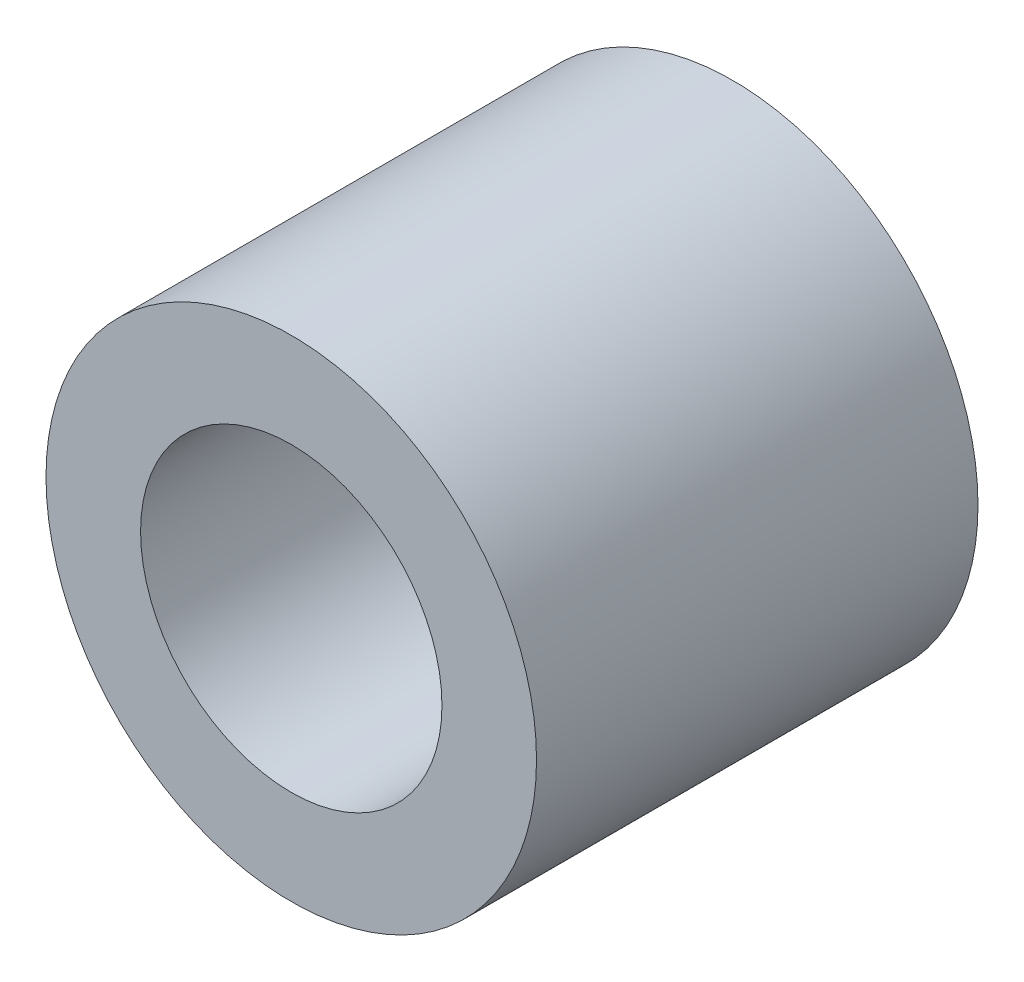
ISO-10303-21;
HEADER;
FILE_DESCRIPTION(('STEP AP214'),'2;1');
FILE_NAME('part.step','',(''),(''),'','','');
FILE_SCHEMA(('AUTOMOTIVE_DESIGN { 1 0 10303 214 1 1 1 1 }'));
ENDSEC;
DATA;
#1=APPLICATION_CONTEXT('core data for automotive mechanical design processes');
#2=APPLICATION_PROTOCOL_DEFINITION('international standard','automotive_design',2000,#1);
#3=PRODUCT_CONTEXT('',#1,'mechanical');
#4=PRODUCT('Part','Part','',(#3));
#5=PRODUCT_RELATED_PRODUCT_CATEGORY('part','',(#4));
#6=PRODUCT_DEFINITION_FORMATION('','',#4);
#7=PRODUCT_DEFINITION_CONTEXT('part definition',#1,'design');
#8=PRODUCT_DEFINITION('design','',#6,#7);
#9=PRODUCT_DEFINITION_SHAPE('','',#8);
#10=(LENGTH_UNIT() NAMED_UNIT(*) SI_UNIT(.MILLI.,.METRE.));
#11=(NAMED_UNIT(*) PLANE_ANGLE_UNIT() SI_UNIT($,.RADIAN.));
#12=(NAMED_UNIT(*) SI_UNIT($,.STERADIAN.) SOLID_ANGLE_UNIT());
#13=UNCERTAINTY_MEASURE_WITH_UNIT(LENGTH_MEASURE(1.E-05),#10,'distance_accuracy_value','');
#14=(GEOMETRIC_REPRESENTATION_CONTEXT(3) GLOBAL_UNCERTAINTY_ASSIGNED_CONTEXT((#13)) GLOBAL_UNIT_ASSIGNED_CONTEXT((#10,
#11,#12)) REPRESENTATION_CONTEXT('',''));
#15=CARTESIAN_POINT('',(0.,0.,0.));
#16=DIRECTION('',(0.,0.,1.));
#17=DIRECTION('',(1.,0.,0.));
#18=AXIS2_PLACEMENT_3D('',#15,#16,#17);
#19=CARTESIAN_POINT('',(0.,0.,3.571875));
#20=DIRECTION('',(0.,0.,1.));
#21=DIRECTION('',(1.,0.,0.));
#22=AXIS2_PLACEMENT_3D('',#19,#20,#21);
#23=PLANE('',#22);
#24=CARTESIAN_POINT('',(0.,0.,3.571875));
#25=DIRECTION('',(0.,0.,1.));
#26=DIRECTION('',(1.,0.,0.));
#27=AXIS2_PLACEMENT_3D('',#24,#25,#26);
#28=CIRCLE('',#27,3.96875);
#29=CARTESIAN_POINT('',(3.96875,0.,3.571875));
#30=VERTEX_POINT('',#29);
#31=EDGE_CURVE('E10',#30,#30,#28,.T.);
#32=ORIENTED_EDGE('',*,*,#31,.T.);
#33=EDGE_LOOP('',(#32));
#34=FACE_BOUND('',#33,.T.);
#35=CARTESIAN_POINT('',(0.,0.,3.571875));
#36=DIRECTION('',(0.,0.,1.));
#37=DIRECTION('',(1.,0.,0.));
#38=AXIS2_PLACEMENT_3D('',#35,#36,#37);
#39=CIRCLE('',#38,2.4384);
#40=CARTESIAN_POINT('',(2.4384,0.,3.571875));
#41=VERTEX_POINT('',#40);
#42=EDGE_CURVE('E41',#41,#41,#39,.T.);
#43=ORIENTED_EDGE('',*,*,#42,.F.);
#44=EDGE_LOOP('',(#43));
#45=FACE_BOUND('',#44,.T.);
#46=ADVANCED_FACE('F30',(#34,#45),#23,.T.);
#47=CARTESIAN_POINT('',(0.,0.,-3.571875));
#48=DIRECTION('',(0.,0.,1.));
#49=DIRECTION('',(1.,0.,0.));
#50=AXIS2_PLACEMENT_3D('',#47,#48,#49);
#51=PLANE('',#50);
#52=CARTESIAN_POINT('',(0.,0.,-3.571875));
#53=DIRECTION('',(0.,0.,1.));
#54=DIRECTION('',(1.,0.,0.));
#55=AXIS2_PLACEMENT_3D('',#52,#53,#54);
#56=CIRCLE('',#55,3.96875);
#57=CARTESIAN_POINT('',(3.96875,0.,-3.571875));
#58=VERTEX_POINT('',#57);
#59=EDGE_CURVE('E34',#58,#58,#56,.T.);
#60=ORIENTED_EDGE('',*,*,#59,.F.);
#61=EDGE_LOOP('',(#60));
#62=FACE_BOUND('',#61,.T.);
#63=CARTESIAN_POINT('',(0.,0.,-3.571875));
#64=DIRECTION('',(0.,0.,1.));
#65=DIRECTION('',(1.,0.,0.));
#66=AXIS2_PLACEMENT_3D('',#63,#64,#65);
#67=CIRCLE('',#66,2.4384);
#68=CARTESIAN_POINT('',(2.4384,0.,-3.571875));
#69=VERTEX_POINT('',#68);
#70=EDGE_CURVE('E43',#69,#69,#67,.T.);
#71=ORIENTED_EDGE('',*,*,#70,.T.);
#72=EDGE_LOOP('',(#71));
#73=FACE_BOUND('',#72,.T.);
#74=ADVANCED_FACE('F53',(#62,#73),#51,.F.);
#75=CARTESIAN_POINT('',(0.,0.,3.571875));
#76=DIRECTION('',(0.,0.,-1.));
#77=DIRECTION('',(-1.,0.,0.));
#78=AXIS2_PLACEMENT_3D('',#75,#76,#77);
#79=CYLINDRICAL_SURFACE('',#78,3.96875);
#80=ORIENTED_EDGE('',*,*,#31,.F.);
#81=EDGE_LOOP('',(#80));
#82=FACE_BOUND('',#81,.T.);
#83=ORIENTED_EDGE('',*,*,#59,.T.);
#84=EDGE_LOOP('',(#83));
#85=FACE_BOUND('',#84,.T.);
#86=ADVANCED_FACE('F32',(#82,#85),#79,.T.);
#87=CARTESIAN_POINT('',(0.,0.,3.571875));
#88=DIRECTION('',(0.,0.,-1.));
#89=DIRECTION('',(-1.,0.,0.));
#90=AXIS2_PLACEMENT_3D('',#87,#88,#89);
#91=CYLINDRICAL_SURFACE('',#90,2.4384);
#92=ORIENTED_EDGE('',*,*,#42,.T.);
#93=EDGE_LOOP('',(#92));
#94=FACE_BOUND('',#93,.T.);
#95=ORIENTED_EDGE('',*,*,#70,.F.);
#96=EDGE_LOOP('',(#95));
#97=FACE_BOUND('',#96,.T.);
#98=ADVANCED_FACE('F49',(#94,#97),#91,.F.);
#99=CLOSED_SHELL('',(#46,#74,#86,#98));
#100=MANIFOLD_SOLID_BREP('B2',#99);
#101=ADVANCED_BREP_SHAPE_REPRESENTATION('',(#18,#100),#14);
#102=SHAPE_DEFINITION_REPRESENTATION(#9,#101);
ENDSEC;
END-ISO-10303-21;
